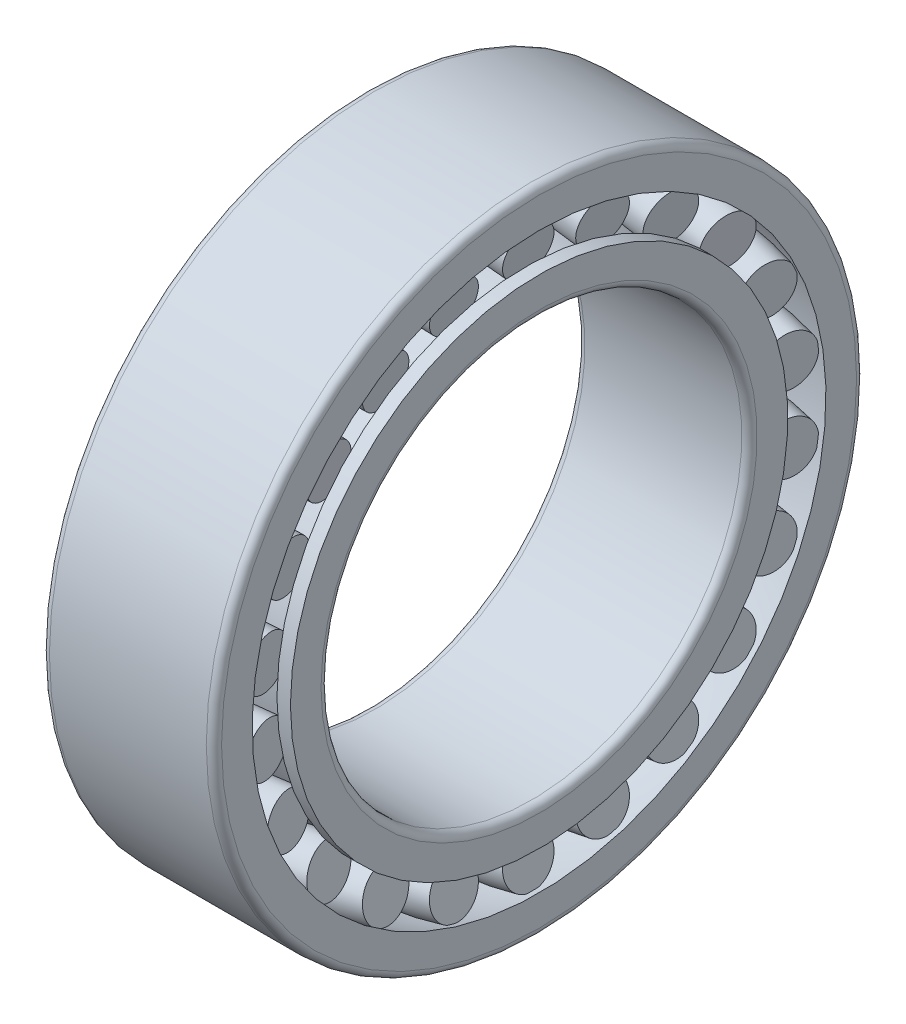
from build123d import *

# Parameters (mm, degrees)
CIRCULAR_PATTERN1_COUNT = 22
FILLET1_R               = 2
FILLET2_R               = 2


with BuildPart() as part:
    # Sketch1 → Revolve1 (revolve)
    with BuildSketch(Plane.XY, mode=Mode.PRIVATE) as revolve1_sk:
        with BuildLine():
            Line((-3.75, 65), (3.75, 65))
            ThreePointArc((3.75, 65), (13.040289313, 63.036001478), (22.5, 62.21099274))
            Line((22.5, 62.21099274), (22.5, 55))
            Line((22.5, 55), (-22.5, 55))
            Line((-22.5, 55), (-22.5, 62.21099274))
            ThreePointArc((-22.5, 62.21099274), (-13.040289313, 63.036001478), (-3.75, 65))
        make_face()
    revolve(revolve1_sk.sketch.rotate(Axis((-22.5, 0, 0), (1, 0, 0)), 90), axis=Axis((-22.5, 0, 0), (1, 0, 0)))

    # Fillet2
    fillet2_edges = [part.edges().sort_by_distance(p)[0] for p in [
        (22.5, 0, -55),
        (-22.5, 0, -55),
    ]]
    fillet(fillet2_edges, radius=FILLET2_R)

    # Sketch4 → Revolve4 (revolve)
    with BuildSketch(Plane.XY, mode=Mode.PRIVATE) as revolve4_sk:
        with BuildLine():
            Line((-18.977508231, 65), (-18.525890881, 62.416775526))
            ThreePointArc((-18.525890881, 62.416775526), (-20.511637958, 62.288633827), (-22.5, 62.21099274))
            Line((-22.5, 62.21099274), (-22.5, 65))
            Line((-22.5, 65), (-18.977508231, 65))
        make_face()
    revolve4 = revolve(revolve4_sk.sketch.rotate(Axis((-22.5, 0, 0), (1, 0, 0)), 90), axis=Axis((-22.5, 0, 0), (1, 0, 0)))

    # Mirror2: Revolve4 across plane
    add(revolve4.mirror(Plane(origin=(0, 0, 0), x_dir=(0, 0, 1), z_dir=(1, 0, 0))))


with BuildPart() as body_2:
    # Sketch2 → Revolve2 (revolve)
    with BuildSketch(Plane.XY, mode=Mode.PRIVATE) as revolve2_sk:
        with BuildLine():
            Line((-4.892441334, 71.534696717), (-6.034882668, 78.069393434))
            ThreePointArc((-6.034882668, 78.069393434), (-13.484827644, 77.132414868), (-20.810773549, 75.48616896))
            Line((-20.810773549, 75.48616896), (-19.668332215, 68.951472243))
            Line((-19.668332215, 68.951472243), (-4.892441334, 71.534696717))
        make_face()
    revolve(revolve2_sk.sketch.rotate(Axis((-19.668332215, 68.951472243, 0), (0.9850593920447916, 0.1722149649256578, 0)), 180), axis=Axis((-19.668332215, 68.951472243, 0), (0.9850593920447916, 0.1722149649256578, 0)))


with BuildPart() as body_3:
    # Sketch3 → Revolve3 (revolve)
    with BuildSketch(Plane.XY):
        with BuildLine():
            Line((-22.5, 75), (-22.5, 85))
            Line((-22.5, 85), (22.5, 85))
            Line((22.5, 85), (22.5, 75))
            ThreePointArc((22.5, 75), (0, 78.302298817), (-22.5, 75))
        make_face()
    revolve(axis=Axis((-22.5, 0, 0), (1, 0, 0)))

    # Fillet1
    fillet1_edges = [body_3.edges().sort_by_distance(p)[0] for p in [
        (-22.5, -85, 0),
        (22.5, -85, 0),
    ]]
    fillet(fillet1_edges, radius=FILLET1_R)


with BuildPart() as body_4:
    # Mirror1: mirrored copy
    add(body_2.part.mirror(Plane(origin=(0, 0, 0), x_dir=(0, 0, 1), z_dir=(1, 0, 0))))


with BuildPart() as circular_pattern1_1:
    # Circular-Pattern1: pattern copy
    add(body_4.part.rotate(Axis((0, 0, 0), (1, 0, 0)), 1 * 360 / CIRCULAR_PATTERN1_COUNT))


with BuildPart() as circular_pattern1_2:
    # Circular-Pattern1: pattern copy
    add(body_4.part.rotate(Axis((0, 0, 0), (1, 0, 0)), 2 * 360 / CIRCULAR_PATTERN1_COUNT))


with BuildPart() as circular_pattern1_3:
    # Circular-Pattern1: pattern copy
    add(body_4.part.rotate(Axis((0, 0, 0), (1, 0, 0)), 3 * 360 / CIRCULAR_PATTERN1_COUNT))


with BuildPart() as circular_pattern1_4:
    # Circular-Pattern1: pattern copy
    add(body_4.part.rotate(Axis((0, 0, 0), (1, 0, 0)), 4 * 360 / CIRCULAR_PATTERN1_COUNT))


with BuildPart() as circular_pattern1_5:
    # Circular-Pattern1: pattern copy
    add(body_4.part.rotate(Axis((0, 0, 0), (1, 0, 0)), 5 * 360 / CIRCULAR_PATTERN1_COUNT))


with BuildPart() as circular_pattern1_6:
    # Circular-Pattern1: pattern copy
    add(body_4.part.rotate(Axis((0, 0, 0), (1, 0, 0)), 6 * 360 / CIRCULAR_PATTERN1_COUNT))


with BuildPart() as circular_pattern1_7:
    # Circular-Pattern1: pattern copy
    add(body_4.part.rotate(Axis((0, 0, 0), (1, 0, 0)), 7 * 360 / CIRCULAR_PATTERN1_COUNT))


with BuildPart() as circular_pattern1_8:
    # Circular-Pattern1: pattern copy
    add(body_4.part.rotate(Axis((0, 0, 0), (1, 0, 0)), 8 * 360 / CIRCULAR_PATTERN1_COUNT))


with BuildPart() as circular_pattern1_9:
    # Circular-Pattern1: pattern copy
    add(body_4.part.rotate(Axis((0, 0, 0), (1, 0, 0)), 9 * 360 / CIRCULAR_PATTERN1_COUNT))


with BuildPart() as circular_pattern1_10:
    # Circular-Pattern1: pattern copy
    add(body_4.part.rotate(Axis((0, 0, 0), (1, 0, 0)), 10 * 360 / CIRCULAR_PATTERN1_COUNT))


with BuildPart() as circular_pattern1_11:
    # Circular-Pattern1: pattern copy
    add(body_4.part.rotate(Axis((0, 0, 0), (1, 0, 0)), 11 * 360 / CIRCULAR_PATTERN1_COUNT))


with BuildPart() as circular_pattern1_12:
    # Circular-Pattern1: pattern copy
    add(body_4.part.rotate(Axis((0, 0, 0), (1, 0, 0)), 12 * 360 / CIRCULAR_PATTERN1_COUNT))


with BuildPart() as circular_pattern1_13:
    # Circular-Pattern1: pattern copy
    add(body_4.part.rotate(Axis((0, 0, 0), (1, 0, 0)), 13 * 360 / CIRCULAR_PATTERN1_COUNT))


with BuildPart() as circular_pattern1_14:
    # Circular-Pattern1: pattern copy
    add(body_4.part.rotate(Axis((0, 0, 0), (1, 0, 0)), 14 * 360 / CIRCULAR_PATTERN1_COUNT))


with BuildPart() as circular_pattern1_15:
    # Circular-Pattern1: pattern copy
    add(body_4.part.rotate(Axis((0, 0, 0), (1, 0, 0)), 15 * 360 / CIRCULAR_PATTERN1_COUNT))


with BuildPart() as circular_pattern1_16:
    # Circular-Pattern1: pattern copy
    add(body_4.part.rotate(Axis((0, 0, 0), (1, 0, 0)), 16 * 360 / CIRCULAR_PATTERN1_COUNT))


with BuildPart() as circular_pattern1_17:
    # Circular-Pattern1: pattern copy
    add(body_4.part.rotate(Axis((0, 0, 0), (1, 0, 0)), 17 * 360 / CIRCULAR_PATTERN1_COUNT))


with BuildPart() as circular_pattern1_18:
    # Circular-Pattern1: pattern copy
    add(body_4.part.rotate(Axis((0, 0, 0), (1, 0, 0)), 18 * 360 / CIRCULAR_PATTERN1_COUNT))


with BuildPart() as circular_pattern1_19:
    # Circular-Pattern1: pattern copy
    add(body_4.part.rotate(Axis((0, 0, 0), (1, 0, 0)), 19 * 360 / CIRCULAR_PATTERN1_COUNT))


with BuildPart() as circular_pattern1_20:
    # Circular-Pattern1: pattern copy
    add(body_4.part.rotate(Axis((0, 0, 0), (1, 0, 0)), 20 * 360 / CIRCULAR_PATTERN1_COUNT))


with BuildPart() as circular_pattern1_21:
    # Circular-Pattern1: pattern copy
    add(body_4.part.rotate(Axis((0, 0, 0), (1, 0, 0)), 21 * 360 / CIRCULAR_PATTERN1_COUNT))


with BuildPart() as circular_pattern1_22:
    # Circular-Pattern1: pattern copy
    add(body_2.part.rotate(Axis((0, 0, 0), (1, 0, 0)), 1 * 360 / CIRCULAR_PATTERN1_COUNT))


with BuildPart() as circular_pattern1_23:
    # Circular-Pattern1: pattern copy
    add(body_2.part.rotate(Axis((0, 0, 0), (1, 0, 0)), 2 * 360 / CIRCULAR_PATTERN1_COUNT))


with BuildPart() as circular_pattern1_24:
    # Circular-Pattern1: pattern copy
    add(body_2.part.rotate(Axis((0, 0, 0), (1, 0, 0)), 3 * 360 / CIRCULAR_PATTERN1_COUNT))


with BuildPart() as circular_pattern1_25:
    # Circular-Pattern1: pattern copy
    add(body_2.part.rotate(Axis((0, 0, 0), (1, 0, 0)), 4 * 360 / CIRCULAR_PATTERN1_COUNT))


with BuildPart() as circular_pattern1_26:
    # Circular-Pattern1: pattern copy
    add(body_2.part.rotate(Axis((0, 0, 0), (1, 0, 0)), 5 * 360 / CIRCULAR_PATTERN1_COUNT))


with BuildPart() as circular_pattern1_27:
    # Circular-Pattern1: pattern copy
    add(body_2.part.rotate(Axis((0, 0, 0), (1, 0, 0)), 6 * 360 / CIRCULAR_PATTERN1_COUNT))


with BuildPart() as circular_pattern1_28:
    # Circular-Pattern1: pattern copy
    add(body_2.part.rotate(Axis((0, 0, 0), (1, 0, 0)), 7 * 360 / CIRCULAR_PATTERN1_COUNT))


with BuildPart() as circular_pattern1_29:
    # Circular-Pattern1: pattern copy
    add(body_2.part.rotate(Axis((0, 0, 0), (1, 0, 0)), 8 * 360 / CIRCULAR_PATTERN1_COUNT))


with BuildPart() as circular_pattern1_30:
    # Circular-Pattern1: pattern copy
    add(body_2.part.rotate(Axis((0, 0, 0), (1, 0, 0)), 9 * 360 / CIRCULAR_PATTERN1_COUNT))


with BuildPart() as circular_pattern1_31:
    # Circular-Pattern1: pattern copy
    add(body_2.part.rotate(Axis((0, 0, 0), (1, 0, 0)), 10 * 360 / CIRCULAR_PATTERN1_COUNT))


with BuildPart() as circular_pattern1_32:
    # Circular-Pattern1: pattern copy
    add(body_2.part.rotate(Axis((0, 0, 0), (1, 0, 0)), 11 * 360 / CIRCULAR_PATTERN1_COUNT))


with BuildPart() as circular_pattern1_33:
    # Circular-Pattern1: pattern copy
    add(body_2.part.rotate(Axis((0, 0, 0), (1, 0, 0)), 12 * 360 / CIRCULAR_PATTERN1_COUNT))


with BuildPart() as circular_pattern1_34:
    # Circular-Pattern1: pattern copy
    add(body_2.part.rotate(Axis((0, 0, 0), (1, 0, 0)), 13 * 360 / CIRCULAR_PATTERN1_COUNT))


with BuildPart() as circular_pattern1_35:
    # Circular-Pattern1: pattern copy
    add(body_2.part.rotate(Axis((0, 0, 0), (1, 0, 0)), 14 * 360 / CIRCULAR_PATTERN1_COUNT))


with BuildPart() as circular_pattern1_36:
    # Circular-Pattern1: pattern copy
    add(body_2.part.rotate(Axis((0, 0, 0), (1, 0, 0)), 15 * 360 / CIRCULAR_PATTERN1_COUNT))


with BuildPart() as circular_pattern1_37:
    # Circular-Pattern1: pattern copy
    add(body_2.part.rotate(Axis((0, 0, 0), (1, 0, 0)), 16 * 360 / CIRCULAR_PATTERN1_COUNT))


with BuildPart() as circular_pattern1_38:
    # Circular-Pattern1: pattern copy
    add(body_2.part.rotate(Axis((0, 0, 0), (1, 0, 0)), 17 * 360 / CIRCULAR_PATTERN1_COUNT))


with BuildPart() as circular_pattern1_39:
    # Circular-Pattern1: pattern copy
    add(body_2.part.rotate(Axis((0, 0, 0), (1, 0, 0)), 18 * 360 / CIRCULAR_PATTERN1_COUNT))


with BuildPart() as circular_pattern1_40:
    # Circular-Pattern1: pattern copy
    add(body_2.part.rotate(Axis((0, 0, 0), (1, 0, 0)), 19 * 360 / CIRCULAR_PATTERN1_COUNT))


with BuildPart() as circular_pattern1_41:
    # Circular-Pattern1: pattern copy
    add(body_2.part.rotate(Axis((0, 0, 0), (1, 0, 0)), 20 * 360 / CIRCULAR_PATTERN1_COUNT))


with BuildPart() as circular_pattern1_42:
    # Circular-Pattern1: pattern copy
    add(body_2.part.rotate(Axis((0, 0, 0), (1, 0, 0)), 21 * 360 / CIRCULAR_PATTERN1_COUNT))


solid = Compound([part.part, body_2.part, body_3.part, body_4.part, circular_pattern1_1.part, circular_pattern1_2.part, circular_pattern1_3.part, circular_pattern1_4.part, circular_pattern1_5.part, circular_pattern1_6.part, circular_pattern1_7.part, circular_pattern1_8.part, circular_pattern1_9.part, circular_pattern1_10.part, circular_pattern1_11.part, circular_pattern1_12.part, circular_pattern1_13.part, circular_pattern1_14.part, circular_pattern1_15.part, circular_pattern1_16.part, circular_pattern1_17.part, circular_pattern1_18.part, circular_pattern1_19.part, circular_pattern1_20.part, circular_pattern1_21.part, circular_pattern1_22.part, circular_pattern1_23.part, circular_pattern1_24.part, circular_pattern1_25.part, circular_pattern1_26.part, circular_pattern1_27.part, circular_pattern1_28.part, circular_pattern1_29.part, circular_pattern1_30.part, circular_pattern1_31.part, circular_pattern1_32.part, circular_pattern1_33.part, circular_pattern1_34.part, circular_pattern1_35.part, circular_pattern1_36.part, circular_pattern1_37.part, circular_pattern1_38.part, circular_pattern1_39.part, circular_pattern1_40.part, circular_pattern1_41.part, circular_pattern1_42.part])
